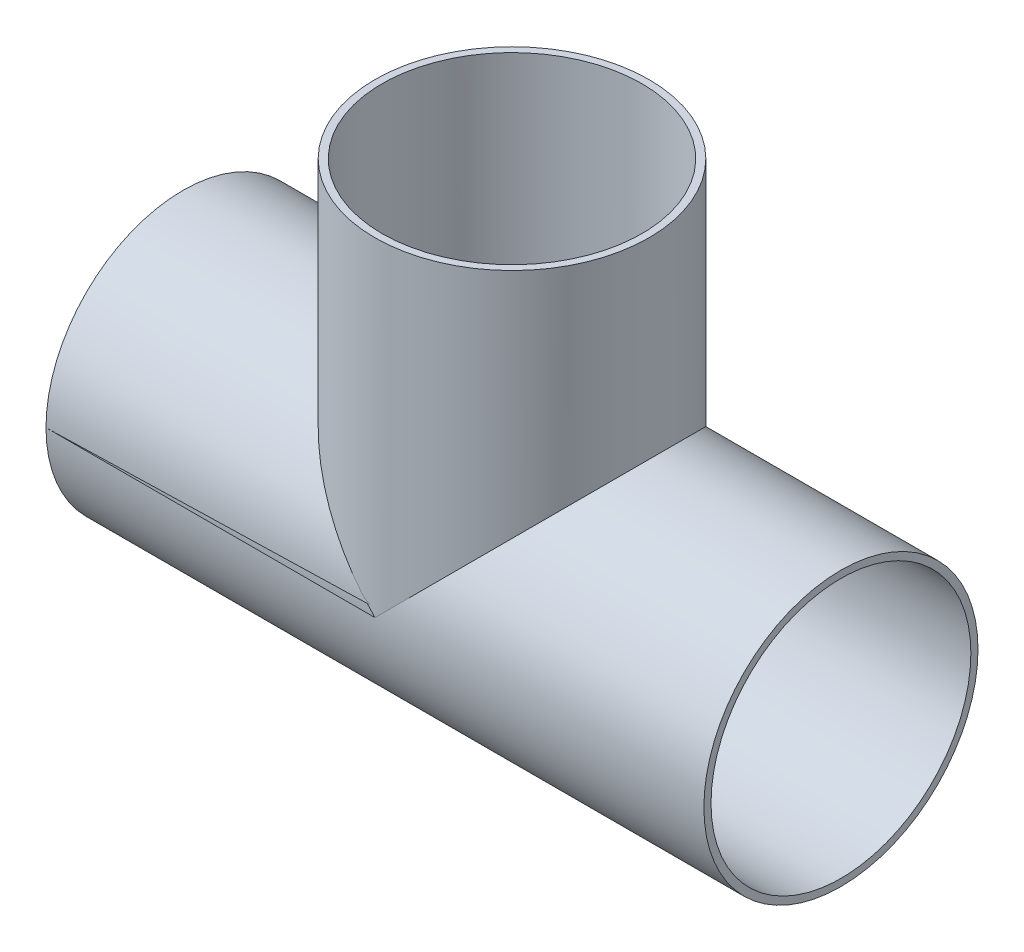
from build123d import *

# Parameters (mm, degrees)
SKETCH1_R           = 31.75
BOSS_EXTRUDE1_DEPTH = 76.2
SKETCH2_R           = 31.75
BOSS_EXTRUDE2_DEPTH = 76.2
SKETCH3_R           = 30.099
CUT_EXTRUDE1_DEPTH  = 76.2
SKETCH4_R           = 30.099
CUT_EXTRUDE2_DEPTH  = 174.321269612


with BuildPart() as part:
    # Sketch1 → Boss-Extrude1 (new body)
    with BuildSketch(Plane(origin=(0, 0, 0), x_dir=(1, 0, 0), z_dir=(0, 1, 0))):
        with Locations(Location((0, 0, 0), (0, 0, 90))):
            Circle(SKETCH1_R)
    extrude(amount=BOSS_EXTRUDE1_DEPTH)

    # Sketch2 → Boss-Extrude2 (add, symmetric)
    with BuildSketch(Plane(origin=(0, 0, 0), x_dir=(0, 0, -1), z_dir=(1, 0, 0))):
        Circle(SKETCH2_R)
    extrude(amount=BOSS_EXTRUDE2_DEPTH, both=True)

    # Sketch3 → Cut-Extrude1 (cut)
    with BuildSketch(Plane(origin=(0, 76.2, 0), x_dir=(1, 0, 0), z_dir=(0, 1, 0))):
        with Locations(Location((0, 0, 0), (0, 0, 270))):
            Circle(SKETCH3_R)
    extrude(amount=-CUT_EXTRUDE1_DEPTH, mode=Mode.SUBTRACT)

    # Sketch4 → Cut-Extrude2 (cut, through all)
    with BuildSketch(Plane(origin=(76.2, 0, 0), x_dir=(0, 0, -1), z_dir=(1, 0, 0))):
        Circle(SKETCH4_R)
    extrude(amount=-CUT_EXTRUDE2_DEPTH, mode=Mode.SUBTRACT)


solid = part.part
